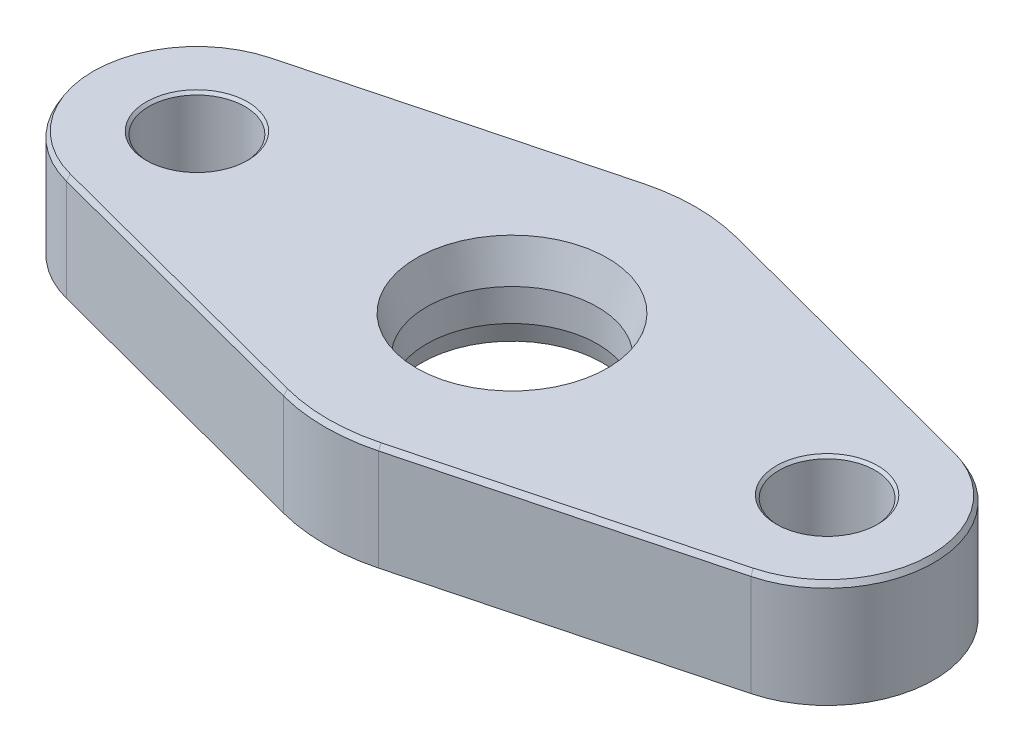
ISO-10303-21;
HEADER;
FILE_DESCRIPTION(('STEP AP214'),'2;1');
FILE_NAME('part.step','',(''),(''),'','','');
FILE_SCHEMA(('AUTOMOTIVE_DESIGN { 1 0 10303 214 1 1 1 1 }'));
ENDSEC;
DATA;
#1=APPLICATION_CONTEXT('core data for automotive mechanical design processes');
#2=APPLICATION_PROTOCOL_DEFINITION('international standard','automotive_design',2000,#1);
#3=PRODUCT_CONTEXT('',#1,'mechanical');
#4=PRODUCT('Part','Part','',(#3));
#5=PRODUCT_RELATED_PRODUCT_CATEGORY('part','',(#4));
#6=PRODUCT_DEFINITION_FORMATION('','',#4);
#7=PRODUCT_DEFINITION_CONTEXT('part definition',#1,'design');
#8=PRODUCT_DEFINITION('design','',#6,#7);
#9=PRODUCT_DEFINITION_SHAPE('','',#8);
#10=(LENGTH_UNIT() NAMED_UNIT(*) SI_UNIT(.MILLI.,.METRE.));
#11=(NAMED_UNIT(*) PLANE_ANGLE_UNIT() SI_UNIT($,.RADIAN.));
#12=(NAMED_UNIT(*) SI_UNIT($,.STERADIAN.) SOLID_ANGLE_UNIT());
#13=UNCERTAINTY_MEASURE_WITH_UNIT(LENGTH_MEASURE(1.E-05),#10,'distance_accuracy_value','');
#14=(GEOMETRIC_REPRESENTATION_CONTEXT(3) GLOBAL_UNCERTAINTY_ASSIGNED_CONTEXT((#13)) GLOBAL_UNIT_ASSIGNED_CONTEXT((#10,
#11,#12)) REPRESENTATION_CONTEXT('',''));
#15=CARTESIAN_POINT('',(0.,0.,0.));
#16=DIRECTION('',(0.,0.,1.));
#17=DIRECTION('',(1.,0.,0.));
#18=AXIS2_PLACEMENT_3D('',#15,#16,#17);
#19=CARTESIAN_POINT('',(0.,0.,0.));
#20=DIRECTION('',(0.,-1.,0.));
#21=DIRECTION('',(0.,0.,-1.));
#22=AXIS2_PLACEMENT_3D('',#19,#20,#21);
#23=PLANE('',#22);
#24=CARTESIAN_POINT('',(-29.5,0.,0.));
#25=DIRECTION('',(0.,1.,0.));
#26=DIRECTION('',(0.,0.,1.));
#27=AXIS2_PLACEMENT_3D('',#24,#25,#26);
#28=CIRCLE('',#27,4.75);
#29=CARTESIAN_POINT('',(-29.5,0.,4.75));
#30=VERTEX_POINT('',#29);
#31=EDGE_CURVE('E566',#30,#30,#28,.T.);
#32=ORIENTED_EDGE('',*,*,#31,.T.);
#33=EDGE_LOOP('',(#32));
#34=FACE_BOUND('',#33,.T.);
#35=CARTESIAN_POINT('',(0.,0.,0.));
#36=DIRECTION('',(0.,1.,0.));
#37=DIRECTION('',(0.,0.,-1.));
#38=AXIS2_PLACEMENT_3D('',#35,#36,#37);
#39=CIRCLE('',#38,17.5);
#40=CARTESIAN_POINT('',(4.44915254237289,0.,-16.9249827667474));
#41=VERTEX_POINT('',#40);
#42=CARTESIAN_POINT('',(-4.44915254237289,0.,-16.9249827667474));
#43=VERTEX_POINT('',#42);
#44=EDGE_CURVE('E137',#41,#43,#39,.T.);
#45=ORIENTED_EDGE('',*,*,#44,.F.);
#46=DIRECTION('',(-0.967141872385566,0.,-0.254237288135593));
#47=VECTOR('',#46,1.);
#48=CARTESIAN_POINT('',(32.0423728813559,0.,-9.67141872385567));
#49=LINE('',#48,#47);
#50=CARTESIAN_POINT('',(32.0423728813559,0.,-9.67141872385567));
#51=VERTEX_POINT('',#50);
#52=EDGE_CURVE('E165',#51,#41,#49,.T.);
#53=ORIENTED_EDGE('',*,*,#52,.F.);
#54=CARTESIAN_POINT('',(29.5,0.,0.));
#55=DIRECTION('',(0.,1.,0.));
#56=DIRECTION('',(0.,0.,-1.));
#57=AXIS2_PLACEMENT_3D('',#54,#55,#56);
#58=CIRCLE('',#57,10.);
#59=CARTESIAN_POINT('',(32.0423728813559,0.,9.67141872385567));
#60=VERTEX_POINT('',#59);
#61=EDGE_CURVE('E162',#60,#51,#58,.T.);
#62=ORIENTED_EDGE('',*,*,#61,.F.);
#63=DIRECTION('',(0.967141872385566,0.,-0.254237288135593));
#64=VECTOR('',#63,1.);
#65=CARTESIAN_POINT('',(32.0423728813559,0.,9.67141872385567));
#66=LINE('',#65,#64);
#67=CARTESIAN_POINT('',(4.44915254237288,0.,16.9249827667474));
#68=VERTEX_POINT('',#67);
#69=EDGE_CURVE('E159',#68,#60,#66,.T.);
#70=ORIENTED_EDGE('',*,*,#69,.F.);
#71=CARTESIAN_POINT('',(0.,0.,0.));
#72=DIRECTION('',(0.,1.,0.));
#73=DIRECTION('',(0.,0.,1.));
#74=AXIS2_PLACEMENT_3D('',#71,#72,#73);
#75=CIRCLE('',#74,17.5);
#76=CARTESIAN_POINT('',(-4.44915254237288,0.,16.9249827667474));
#77=VERTEX_POINT('',#76);
#78=EDGE_CURVE('E156',#77,#68,#75,.T.);
#79=ORIENTED_EDGE('',*,*,#78,.F.);
#80=DIRECTION('',(0.967141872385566,0.,0.254237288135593));
#81=VECTOR('',#80,1.);
#82=CARTESIAN_POINT('',(-32.0423728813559,0.,9.67141872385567));
#83=LINE('',#82,#81);
#84=CARTESIAN_POINT('',(-32.0423728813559,0.,9.67141872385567));
#85=VERTEX_POINT('',#84);
#86=EDGE_CURVE('E153',#85,#77,#83,.T.);
#87=ORIENTED_EDGE('',*,*,#86,.F.);
#88=CARTESIAN_POINT('',(-29.5,0.,0.));
#89=DIRECTION('',(0.,1.,0.));
#90=DIRECTION('',(0.,0.,1.));
#91=AXIS2_PLACEMENT_3D('',#88,#89,#90);
#92=CIRCLE('',#91,10.);
#93=CARTESIAN_POINT('',(-32.0423728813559,0.,-9.67141872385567));
#94=VERTEX_POINT('',#93);
#95=EDGE_CURVE('E140',#94,#85,#92,.T.);
#96=ORIENTED_EDGE('',*,*,#95,.F.);
#97=DIRECTION('',(-0.967141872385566,0.,0.254237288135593));
#98=VECTOR('',#97,1.);
#99=CARTESIAN_POINT('',(-32.0423728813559,0.,-9.67141872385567));
#100=LINE('',#99,#98);
#101=EDGE_CURVE('E123',#43,#94,#100,.T.);
#102=ORIENTED_EDGE('',*,*,#101,.F.);
#103=EDGE_LOOP('',(#45,#53,#62,#70,#79,#87,#96,#102));
#104=FACE_BOUND('',#103,.T.);
#105=CARTESIAN_POINT('',(0.,0.,0.));
#106=DIRECTION('',(0.,-1.,0.));
#107=DIRECTION('',(0.,0.,-1.));
#108=AXIS2_PLACEMENT_3D('',#105,#106,#107);
#109=CIRCLE('',#108,14.9282032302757);
#110=CARTESIAN_POINT('',(0.,0.,-14.9282032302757));
#111=VERTEX_POINT('',#110);
#112=EDGE_CURVE('E225',#111,#111,#109,.F.);
#113=ORIENTED_EDGE('',*,*,#112,.T.);
#114=EDGE_LOOP('',(#113));
#115=FACE_BOUND('',#114,.T.);
#116=CARTESIAN_POINT('',(29.5,0.,-2.05997518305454E-13));
#117=DIRECTION('',(0.,1.,0.));
#118=DIRECTION('',(0.,0.,1.));
#119=AXIS2_PLACEMENT_3D('',#116,#117,#118);
#120=CIRCLE('',#119,4.75);
#121=CARTESIAN_POINT('',(29.5,0.,4.74999999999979));
#122=VERTEX_POINT('',#121);
#123=EDGE_CURVE('E554',#122,#122,#120,.T.);
#124=ORIENTED_EDGE('',*,*,#123,.T.);
#125=EDGE_LOOP('',(#124));
#126=FACE_BOUND('',#125,.T.);
#127=ADVANCED_FACE('F28',(#34,#104,#115,#126),#23,.T.);
#128=CARTESIAN_POINT('',(0.,0.,0.));
#129=DIRECTION('',(0.,-1.,0.));
#130=DIRECTION('',(0.,0.,-1.));
#131=AXIS2_PLACEMENT_3D('',#128,#129,#130);
#132=CONICAL_SURFACE('',#131,8.93782217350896,0.261799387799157);
#133=CARTESIAN_POINT('',(0.,3.5,0.));
#134=DIRECTION('',(0.,-1.,0.));
#135=DIRECTION('',(0.,0.,-1.));
#136=AXIS2_PLACEMENT_3D('',#133,#134,#135);
#137=CIRCLE('',#136,8.);
#138=CARTESIAN_POINT('',(0.,3.5,-8.));
#139=VERTEX_POINT('',#138);
#140=EDGE_CURVE('E37',#139,#139,#137,.T.);
#141=ORIENTED_EDGE('',*,*,#140,.F.);
#142=EDGE_LOOP('',(#141));
#143=FACE_BOUND('',#142,.T.);
#144=CARTESIAN_POINT('',(0.,1.72927405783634,0.));
#145=DIRECTION('',(0.,-1.,0.));
#146=DIRECTION('',(0.,0.,-1.));
#147=AXIS2_PLACEMENT_3D('',#144,#145,#146);
#148=CIRCLE('',#147,8.47446458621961);
#149=CARTESIAN_POINT('',(0.,1.72927405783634,-8.47446458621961));
#150=VERTEX_POINT('',#149);
#151=EDGE_CURVE('E32',#150,#150,#148,.T.);
#152=ORIENTED_EDGE('',*,*,#151,.T.);
#153=EDGE_LOOP('',(#152));
#154=FACE_BOUND('',#153,.T.);
#155=ADVANCED_FACE('F218',(#143,#154),#132,.F.);
#156=CARTESIAN_POINT('',(0.,9.99999999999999,0.));
#157=DIRECTION('',(0.,-1.,0.));
#158=DIRECTION('',(0.,0.,-1.));
#159=AXIS2_PLACEMENT_3D('',#156,#157,#158);
#160=CYLINDRICAL_SURFACE('',#159,17.5);
#161=DIRECTION('',(0.,-1.,0.));
#162=VECTOR('',#161,1.);
#163=CARTESIAN_POINT('',(-4.44915254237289,9.99999999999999,-16.9249827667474));
#164=LINE('',#163,#162);
#165=CARTESIAN_POINT('',(-4.44915254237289,9.49999999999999,-16.9249827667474));
#166=VERTEX_POINT('',#165);
#167=EDGE_CURVE('E119',#166,#43,#164,.T.);
#168=ORIENTED_EDGE('',*,*,#167,.F.);
#169=CARTESIAN_POINT('',(0.,9.49999999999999,0.));
#170=DIRECTION('',(0.,-1.,0.));
#171=DIRECTION('',(0.,0.,-1.));
#172=AXIS2_PLACEMENT_3D('',#169,#170,#171);
#173=CIRCLE('',#172,17.5);
#174=CARTESIAN_POINT('',(4.44915254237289,9.49999999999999,-16.9249827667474));
#175=VERTEX_POINT('',#174);
#176=EDGE_CURVE('E198',#166,#175,#173,.T.);
#177=ORIENTED_EDGE('',*,*,#176,.T.);
#178=DIRECTION('',(0.,-1.,0.));
#179=VECTOR('',#178,1.);
#180=CARTESIAN_POINT('',(4.44915254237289,9.99999999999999,-16.9249827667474));
#181=LINE('',#180,#179);
#182=EDGE_CURVE('E143',#175,#41,#181,.T.);
#183=ORIENTED_EDGE('',*,*,#182,.T.);
#184=ORIENTED_EDGE('',*,*,#44,.T.);
#185=EDGE_LOOP('',(#168,#177,#183,#184));
#186=FACE_BOUND('',#185,.T.);
#187=ADVANCED_FACE('F30',(#186),#160,.T.);
#188=CARTESIAN_POINT('',(-32.0423728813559,9.99999999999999,-9.67141872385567));
#189=DIRECTION('',(0.254237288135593,0.,0.967141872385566));
#190=DIRECTION('',(0.967141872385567,0.,-0.254237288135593));
#191=AXIS2_PLACEMENT_3D('',#188,#189,#190);
#192=PLANE('',#191);
#193=DIRECTION('',(0.,-1.,0.));
#194=VECTOR('',#193,1.);
#195=CARTESIAN_POINT('',(-32.0423728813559,9.99999999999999,-9.67141872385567));
#196=LINE('',#195,#194);
#197=CARTESIAN_POINT('',(-32.0423728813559,9.49999999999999,-9.67141872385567));
#198=VERTEX_POINT('',#197);
#199=EDGE_CURVE('E131',#198,#94,#196,.T.);
#200=ORIENTED_EDGE('',*,*,#199,.F.);
#201=DIRECTION('',(0.967141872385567,0.,-0.254237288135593));
#202=VECTOR('',#201,1.);
#203=CARTESIAN_POINT('',(-32.0423728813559,9.49999999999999,-9.67141872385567));
#204=LINE('',#203,#202);
#205=EDGE_CURVE('E126',#198,#166,#204,.T.);
#206=ORIENTED_EDGE('',*,*,#205,.T.);
#207=ORIENTED_EDGE('',*,*,#167,.T.);
#208=ORIENTED_EDGE('',*,*,#101,.T.);
#209=EDGE_LOOP('',(#200,#206,#207,#208));
#210=FACE_BOUND('',#209,.T.);
#211=ADVANCED_FACE('F122',(#210),#192,.F.);
#212=CARTESIAN_POINT('',(-29.5,9.99999999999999,0.));
#213=DIRECTION('',(0.,-1.,0.));
#214=DIRECTION('',(0.,0.,-1.));
#215=AXIS2_PLACEMENT_3D('',#212,#213,#214);
#216=CYLINDRICAL_SURFACE('',#215,10.);
#217=DIRECTION('',(0.,-1.,0.));
#218=VECTOR('',#217,1.);
#219=CARTESIAN_POINT('',(-32.0423728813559,9.99999999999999,9.67141872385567));
#220=LINE('',#219,#218);
#221=CARTESIAN_POINT('',(-32.0423728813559,9.49999999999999,9.67141872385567));
#222=VERTEX_POINT('',#221);
#223=EDGE_CURVE('E176',#222,#85,#220,.T.);
#224=ORIENTED_EDGE('',*,*,#223,.F.);
#225=CARTESIAN_POINT('',(-29.5,9.49999999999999,0.));
#226=DIRECTION('',(0.,-1.,0.));
#227=DIRECTION('',(0.,0.,-1.));
#228=AXIS2_PLACEMENT_3D('',#225,#226,#227);
#229=CIRCLE('',#228,10.);
#230=EDGE_CURVE('E205',#222,#198,#229,.T.);
#231=ORIENTED_EDGE('',*,*,#230,.T.);
#232=ORIENTED_EDGE('',*,*,#199,.T.);
#233=ORIENTED_EDGE('',*,*,#95,.T.);
#234=EDGE_LOOP('',(#224,#231,#232,#233));
#235=FACE_BOUND('',#234,.T.);
#236=ADVANCED_FACE('F334',(#235),#216,.T.);
#237=CARTESIAN_POINT('',(-32.0423728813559,9.99999999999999,9.67141872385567));
#238=DIRECTION('',(0.254237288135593,0.,-0.967141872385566));
#239=DIRECTION('',(-0.967141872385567,0.,-0.254237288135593));
#240=AXIS2_PLACEMENT_3D('',#237,#238,#239);
#241=PLANE('',#240);
#242=DIRECTION('',(0.,-1.,0.));
#243=VECTOR('',#242,1.);
#244=CARTESIAN_POINT('',(-4.44915254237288,9.99999999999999,16.9249827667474));
#245=LINE('',#244,#243);
#246=CARTESIAN_POINT('',(-4.44915254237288,9.49999999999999,16.9249827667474));
#247=VERTEX_POINT('',#246);
#248=EDGE_CURVE('E174',#247,#77,#245,.T.);
#249=ORIENTED_EDGE('',*,*,#248,.F.);
#250=DIRECTION('',(-0.967141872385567,0.,-0.254237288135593));
#251=VECTOR('',#250,1.);
#252=CARTESIAN_POINT('',(-32.0423728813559,9.49999999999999,9.67141872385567));
#253=LINE('',#252,#251);
#254=EDGE_CURVE('E51',#247,#222,#253,.T.);
#255=ORIENTED_EDGE('',*,*,#254,.T.);
#256=ORIENTED_EDGE('',*,*,#223,.T.);
#257=ORIENTED_EDGE('',*,*,#86,.T.);
#258=EDGE_LOOP('',(#249,#255,#256,#257));
#259=FACE_BOUND('',#258,.T.);
#260=ADVANCED_FACE('F331',(#259),#241,.F.);
#261=CARTESIAN_POINT('',(0.,9.99999999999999,0.));
#262=DIRECTION('',(0.,-1.,0.));
#263=DIRECTION('',(0.,0.,-1.));
#264=AXIS2_PLACEMENT_3D('',#261,#262,#263);
#265=CYLINDRICAL_SURFACE('',#264,17.5);
#266=DIRECTION('',(0.,-1.,0.));
#267=VECTOR('',#266,1.);
#268=CARTESIAN_POINT('',(4.44915254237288,9.99999999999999,16.9249827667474));
#269=LINE('',#268,#267);
#270=CARTESIAN_POINT('',(4.44915254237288,9.49999999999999,16.9249827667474));
#271=VERTEX_POINT('',#270);
#272=EDGE_CURVE('E172',#271,#68,#269,.T.);
#273=ORIENTED_EDGE('',*,*,#272,.F.);
#274=CARTESIAN_POINT('',(0.,9.49999999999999,0.));
#275=DIRECTION('',(0.,-1.,0.));
#276=DIRECTION('',(0.,0.,-1.));
#277=AXIS2_PLACEMENT_3D('',#274,#275,#276);
#278=CIRCLE('',#277,17.5);
#279=EDGE_CURVE('E44',#271,#247,#278,.T.);
#280=ORIENTED_EDGE('',*,*,#279,.T.);
#281=ORIENTED_EDGE('',*,*,#248,.T.);
#282=ORIENTED_EDGE('',*,*,#78,.T.);
#283=EDGE_LOOP('',(#273,#280,#281,#282));
#284=FACE_BOUND('',#283,.T.);
#285=ADVANCED_FACE('F328',(#284),#265,.T.);
#286=CARTESIAN_POINT('',(32.0423728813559,9.99999999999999,9.67141872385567));
#287=DIRECTION('',(-0.254237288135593,0.,-0.967141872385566));
#288=DIRECTION('',(-0.967141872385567,0.,0.254237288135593));
#289=AXIS2_PLACEMENT_3D('',#286,#287,#288);
#290=PLANE('',#289);
#291=DIRECTION('',(0.,-1.,0.));
#292=VECTOR('',#291,1.);
#293=CARTESIAN_POINT('',(32.0423728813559,9.99999999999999,9.67141872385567));
#294=LINE('',#293,#292);
#295=CARTESIAN_POINT('',(32.0423728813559,9.49999999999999,9.67141872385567));
#296=VERTEX_POINT('',#295);
#297=EDGE_CURVE('E170',#296,#60,#294,.T.);
#298=ORIENTED_EDGE('',*,*,#297,.F.);
#299=DIRECTION('',(-0.967141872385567,0.,0.254237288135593));
#300=VECTOR('',#299,1.);
#301=CARTESIAN_POINT('',(32.0423728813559,9.49999999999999,9.67141872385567));
#302=LINE('',#301,#300);
#303=EDGE_CURVE('E203',#296,#271,#302,.T.);
#304=ORIENTED_EDGE('',*,*,#303,.T.);
#305=ORIENTED_EDGE('',*,*,#272,.T.);
#306=ORIENTED_EDGE('',*,*,#69,.T.);
#307=EDGE_LOOP('',(#298,#304,#305,#306));
#308=FACE_BOUND('',#307,.T.);
#309=ADVANCED_FACE('F295',(#308),#290,.F.);
#310=CARTESIAN_POINT('',(29.5,9.99999999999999,0.));
#311=DIRECTION('',(0.,-1.,0.));
#312=DIRECTION('',(0.,0.,-1.));
#313=AXIS2_PLACEMENT_3D('',#310,#311,#312);
#314=CYLINDRICAL_SURFACE('',#313,10.);
#315=DIRECTION('',(0.,-1.,0.));
#316=VECTOR('',#315,1.);
#317=CARTESIAN_POINT('',(32.0423728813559,9.99999999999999,-9.67141872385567));
#318=LINE('',#317,#316);
#319=CARTESIAN_POINT('',(32.0423728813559,9.49999999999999,-9.67141872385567));
#320=VERTEX_POINT('',#319);
#321=EDGE_CURVE('E168',#320,#51,#318,.T.);
#322=ORIENTED_EDGE('',*,*,#321,.F.);
#323=CARTESIAN_POINT('',(29.5,9.49999999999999,0.));
#324=DIRECTION('',(0.,-1.,0.));
#325=DIRECTION('',(0.,0.,-1.));
#326=AXIS2_PLACEMENT_3D('',#323,#324,#325);
#327=CIRCLE('',#326,10.);
#328=EDGE_CURVE('E200',#320,#296,#327,.T.);
#329=ORIENTED_EDGE('',*,*,#328,.T.);
#330=ORIENTED_EDGE('',*,*,#297,.T.);
#331=ORIENTED_EDGE('',*,*,#61,.T.);
#332=EDGE_LOOP('',(#322,#329,#330,#331));
#333=FACE_BOUND('',#332,.T.);
#334=ADVANCED_FACE('F292',(#333),#314,.T.);
#335=CARTESIAN_POINT('',(32.0423728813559,9.99999999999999,-9.67141872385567));
#336=DIRECTION('',(-0.254237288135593,0.,0.967141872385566));
#337=DIRECTION('',(0.967141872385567,0.,0.254237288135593));
#338=AXIS2_PLACEMENT_3D('',#335,#336,#337);
#339=PLANE('',#338);
#340=ORIENTED_EDGE('',*,*,#182,.F.);
#341=DIRECTION('',(0.967141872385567,0.,0.254237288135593));
#342=VECTOR('',#341,1.);
#343=CARTESIAN_POINT('',(32.0423728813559,9.49999999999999,-9.67141872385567));
#344=LINE('',#343,#342);
#345=EDGE_CURVE('E195',#175,#320,#344,.T.);
#346=ORIENTED_EDGE('',*,*,#345,.T.);
#347=ORIENTED_EDGE('',*,*,#321,.T.);
#348=ORIENTED_EDGE('',*,*,#52,.T.);
#349=EDGE_LOOP('',(#340,#346,#347,#348));
#350=FACE_BOUND('',#349,.T.);
#351=ADVANCED_FACE('F279',(#350),#339,.F.);
#352=CARTESIAN_POINT('',(0.,9.99999999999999,0.));
#353=DIRECTION('',(0.,-1.,0.));
#354=DIRECTION('',(0.,0.,-1.));
#355=AXIS2_PLACEMENT_3D('',#352,#353,#354);
#356=PLANE('',#355);
#357=CARTESIAN_POINT('',(29.5,9.99999999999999,-2.05997518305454E-13));
#358=DIRECTION('',(0.,1.,0.));
#359=DIRECTION('',(0.,0.,1.));
#360=AXIS2_PLACEMENT_3D('',#357,#358,#359);
#361=CIRCLE('',#360,4.75);
#362=CARTESIAN_POINT('',(29.5,9.99999999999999,4.7499999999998));
#363=VERTEX_POINT('',#362);
#364=EDGE_CURVE('E563',#363,#363,#361,.T.);
#365=ORIENTED_EDGE('',*,*,#364,.F.);
#366=EDGE_LOOP('',(#365));
#367=FACE_BOUND('',#366,.T.);
#368=CARTESIAN_POINT('',(-29.5,9.99999999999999,0.));
#369=DIRECTION('',(0.,1.,0.));
#370=DIRECTION('',(0.,0.,1.));
#371=AXIS2_PLACEMENT_3D('',#368,#369,#370);
#372=CIRCLE('',#371,4.75);
#373=CARTESIAN_POINT('',(-29.5,9.99999999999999,4.75));
#374=VERTEX_POINT('',#373);
#375=EDGE_CURVE('E226',#374,#374,#372,.T.);
#376=ORIENTED_EDGE('',*,*,#375,.F.);
#377=EDGE_LOOP('',(#376));
#378=FACE_BOUND('',#377,.T.);
#379=CARTESIAN_POINT('',(0.,9.99999999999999,0.));
#380=DIRECTION('',(0.,-1.,0.));
#381=DIRECTION('',(0.,0.,-1.));
#382=AXIS2_PLACEMENT_3D('',#379,#380,#381);
#383=CIRCLE('',#382,8.93782217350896);
#384=CARTESIAN_POINT('',(0.,10.,8.93782217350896));
#385=VERTEX_POINT('',#384);
#386=EDGE_CURVE('E11',#385,#385,#383,.T.);
#387=ORIENTED_EDGE('',*,*,#386,.T.);
#388=EDGE_LOOP('',(#387));
#389=FACE_BOUND('',#388,.T.);
#390=CARTESIAN_POINT('',(29.5,9.99999999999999,0.));
#391=DIRECTION('',(0.,-1.,0.));
#392=DIRECTION('',(0.,0.,-1.));
#393=AXIS2_PLACEMENT_3D('',#390,#391,#392);
#394=CIRCLE('',#393,9.71132486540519);
#395=CARTESIAN_POINT('',(31.9689808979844,9.99999999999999,9.39222891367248));
#396=VERTEX_POINT('',#395);
#397=CARTESIAN_POINT('',(31.9689808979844,9.99999999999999,-9.39222891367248));
#398=VERTEX_POINT('',#397);
#399=EDGE_CURVE('E188',#396,#398,#394,.F.);
#400=ORIENTED_EDGE('',*,*,#399,.T.);
#401=DIRECTION('',(-0.967141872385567,0.,-0.254237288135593));
#402=VECTOR('',#401,1.);
#403=CARTESIAN_POINT('',(4.37576055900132,9.99999999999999,-16.6457929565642));
#404=LINE('',#403,#402);
#405=CARTESIAN_POINT('',(4.37576055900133,9.99999999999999,-16.6457929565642));
#406=VERTEX_POINT('',#405);
#407=EDGE_CURVE('E192',#398,#406,#404,.T.);
#408=ORIENTED_EDGE('',*,*,#407,.T.);
#409=CARTESIAN_POINT('',(0.,9.99999999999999,0.));
#410=DIRECTION('',(0.,-1.,0.));
#411=DIRECTION('',(0.,0.,-1.));
#412=AXIS2_PLACEMENT_3D('',#409,#410,#411);
#413=CIRCLE('',#412,17.2113248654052);
#414=CARTESIAN_POINT('',(-4.37576055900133,9.99999999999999,-16.6457929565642));
#415=VERTEX_POINT('',#414);
#416=EDGE_CURVE('E190',#406,#415,#413,.F.);
#417=ORIENTED_EDGE('',*,*,#416,.T.);
#418=DIRECTION('',(-0.967141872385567,0.,0.254237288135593));
#419=VECTOR('',#418,1.);
#420=CARTESIAN_POINT('',(-4.37576055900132,9.99999999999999,-16.6457929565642));
#421=LINE('',#420,#419);
#422=CARTESIAN_POINT('',(-31.9689808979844,9.99999999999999,-9.39222891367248));
#423=VERTEX_POINT('',#422);
#424=EDGE_CURVE('E186',#415,#423,#421,.T.);
#425=ORIENTED_EDGE('',*,*,#424,.T.);
#426=CARTESIAN_POINT('',(-29.5,9.99999999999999,0.));
#427=DIRECTION('',(0.,-1.,0.));
#428=DIRECTION('',(0.,0.,-1.));
#429=AXIS2_PLACEMENT_3D('',#426,#427,#428);
#430=CIRCLE('',#429,9.71132486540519);
#431=CARTESIAN_POINT('',(-31.9689808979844,9.99999999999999,9.39222891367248));
#432=VERTEX_POINT('',#431);
#433=EDGE_CURVE('E182',#423,#432,#430,.F.);
#434=ORIENTED_EDGE('',*,*,#433,.T.);
#435=DIRECTION('',(0.967141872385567,0.,0.254237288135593));
#436=VECTOR('',#435,1.);
#437=CARTESIAN_POINT('',(-4.37576055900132,9.99999999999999,16.6457929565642));
#438=LINE('',#437,#436);
#439=CARTESIAN_POINT('',(-4.37576055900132,9.99999999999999,16.6457929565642));
#440=VERTEX_POINT('',#439);
#441=EDGE_CURVE('E130',#432,#440,#438,.T.);
#442=ORIENTED_EDGE('',*,*,#441,.T.);
#443=CARTESIAN_POINT('',(0.,9.99999999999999,0.));
#444=DIRECTION('',(0.,-1.,0.));
#445=DIRECTION('',(0.,0.,-1.));
#446=AXIS2_PLACEMENT_3D('',#443,#444,#445);
#447=CIRCLE('',#446,17.2113248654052);
#448=CARTESIAN_POINT('',(4.37576055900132,9.99999999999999,16.6457929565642));
#449=VERTEX_POINT('',#448);
#450=EDGE_CURVE('E180',#440,#449,#447,.F.);
#451=ORIENTED_EDGE('',*,*,#450,.T.);
#452=DIRECTION('',(0.967141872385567,0.,-0.254237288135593));
#453=VECTOR('',#452,1.);
#454=CARTESIAN_POINT('',(4.37576055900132,9.99999999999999,16.6457929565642));
#455=LINE('',#454,#453);
#456=EDGE_CURVE('E184',#449,#396,#455,.T.);
#457=ORIENTED_EDGE('',*,*,#456,.T.);
#458=EDGE_LOOP('',(#400,#408,#417,#425,#434,#442,#451,#457));
#459=FACE_BOUND('',#458,.T.);
#460=ADVANCED_FACE('F267',(#367,#378,#389,#459),#356,.F.);
#461=CARTESIAN_POINT('',(0.,0.,0.));
#462=DIRECTION('',(0.,1.,0.));
#463=DIRECTION('',(0.,0.,1.));
#464=AXIS2_PLACEMENT_3D('',#461,#462,#463);
#465=CYLINDRICAL_SURFACE('',#464,8.);
#466=ORIENTED_EDGE('',*,*,#140,.T.);
#467=EDGE_LOOP('',(#466));
#468=FACE_BOUND('',#467,.T.);
#469=CARTESIAN_POINT('',(0.,6.49999999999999,0.));
#470=DIRECTION('',(0.,-1.,0.));
#471=DIRECTION('',(0.,0.,-1.));
#472=AXIS2_PLACEMENT_3D('',#469,#470,#471);
#473=CIRCLE('',#472,8.);
#474=CARTESIAN_POINT('',(0.,6.49999999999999,8.));
#475=VERTEX_POINT('',#474);
#476=EDGE_CURVE('E209',#475,#475,#473,.F.);
#477=ORIENTED_EDGE('',*,*,#476,.T.);
#478=EDGE_LOOP('',(#477));
#479=FACE_BOUND('',#478,.T.);
#480=ADVANCED_FACE('F215',(#468,#479),#465,.F.);
#481=CARTESIAN_POINT('',(-4.37576055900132,9.99999999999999,16.6457929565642));
#482=DIRECTION('',(0.220175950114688,-0.500000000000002,-0.837569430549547));
#483=DIRECTION('',(0.,0.858640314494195,-0.512578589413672));
#484=AXIS2_PLACEMENT_3D('',#481,#482,#483);
#485=PLANE('',#484);
#486=DIRECTION('',(0.127118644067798,0.866025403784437,-0.483570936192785));
#487=VECTOR('',#486,1.);
#488=CARTESIAN_POINT('',(-32.0423728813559,9.49999999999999,9.67141872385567));
#489=LINE('',#488,#487);
#490=EDGE_CURVE('E148',#222,#432,#489,.T.);
#491=ORIENTED_EDGE('',*,*,#490,.F.);
#492=ORIENTED_EDGE('',*,*,#254,.F.);
#493=DIRECTION('',(-0.127118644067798,-0.866025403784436,0.483570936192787));
#494=VECTOR('',#493,1.);
#495=CARTESIAN_POINT('',(-4.37576055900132,9.99999999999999,16.6457929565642));
#496=LINE('',#495,#494);
#497=EDGE_CURVE('E145',#440,#247,#496,.T.);
#498=ORIENTED_EDGE('',*,*,#497,.F.);
#499=ORIENTED_EDGE('',*,*,#441,.F.);
#500=EDGE_LOOP('',(#491,#492,#498,#499));
#501=FACE_BOUND('',#500,.T.);
#502=ADVANCED_FACE('F263',(#501),#485,.F.);
#503=CARTESIAN_POINT('',(0.,9.99999999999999,0.));
#504=DIRECTION('',(0.,-1.,0.));
#505=DIRECTION('',(0.,0.,-1.));
#506=AXIS2_PLACEMENT_3D('',#503,#504,#505);
#507=CONICAL_SURFACE('',#506,17.2113248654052,0.523598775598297);
#508=ORIENTED_EDGE('',*,*,#497,.T.);
#509=ORIENTED_EDGE('',*,*,#279,.F.);
#510=DIRECTION('',(0.127118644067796,-0.866025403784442,0.483570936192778));
#511=VECTOR('',#510,1.);
#512=CARTESIAN_POINT('',(4.37576055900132,9.99999999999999,16.6457929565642));
#513=LINE('',#512,#511);
#514=EDGE_CURVE('E252',#449,#271,#513,.T.);
#515=ORIENTED_EDGE('',*,*,#514,.F.);
#516=ORIENTED_EDGE('',*,*,#450,.F.);
#517=EDGE_LOOP('',(#508,#509,#515,#516));
#518=FACE_BOUND('',#517,.T.);
#519=ADVANCED_FACE('F302',(#518),#507,.T.);
#520=CARTESIAN_POINT('',(-29.5,9.99999999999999,0.));
#521=DIRECTION('',(0.,-1.,0.));
#522=DIRECTION('',(0.,0.,-1.));
#523=AXIS2_PLACEMENT_3D('',#520,#521,#522);
#524=CONICAL_SURFACE('',#523,9.71132486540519,0.5235987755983);
#525=ORIENTED_EDGE('',*,*,#490,.T.);
#526=ORIENTED_EDGE('',*,*,#433,.F.);
#527=DIRECTION('',(0.127118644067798,0.866025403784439,0.483570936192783));
#528=VECTOR('',#527,1.);
#529=CARTESIAN_POINT('',(-32.0423728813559,9.49999999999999,-9.67141872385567));
#530=LINE('',#529,#528);
#531=EDGE_CURVE('E249',#198,#423,#530,.T.);
#532=ORIENTED_EDGE('',*,*,#531,.F.);
#533=ORIENTED_EDGE('',*,*,#230,.F.);
#534=EDGE_LOOP('',(#525,#526,#532,#533));
#535=FACE_BOUND('',#534,.T.);
#536=ADVANCED_FACE('F259',(#535),#524,.T.);
#537=CARTESIAN_POINT('',(4.37576055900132,9.99999999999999,16.6457929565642));
#538=DIRECTION('',(-0.220175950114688,-0.500000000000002,-0.837569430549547));
#539=DIRECTION('',(0.,0.858640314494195,-0.512578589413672));
#540=AXIS2_PLACEMENT_3D('',#537,#538,#539);
#541=PLANE('',#540);
#542=ORIENTED_EDGE('',*,*,#514,.T.);
#543=ORIENTED_EDGE('',*,*,#303,.F.);
#544=DIRECTION('',(0.127118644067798,-0.866025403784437,0.483570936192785));
#545=VECTOR('',#544,1.);
#546=CARTESIAN_POINT('',(31.9689808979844,9.99999999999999,9.39222891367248));
#547=LINE('',#546,#545);
#548=EDGE_CURVE('E246',#396,#296,#547,.T.);
#549=ORIENTED_EDGE('',*,*,#548,.F.);
#550=ORIENTED_EDGE('',*,*,#456,.F.);
#551=EDGE_LOOP('',(#542,#543,#549,#550));
#552=FACE_BOUND('',#551,.T.);
#553=ADVANCED_FACE('F299',(#552),#541,.F.);
#554=CARTESIAN_POINT('',(-4.37576055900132,9.99999999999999,-16.6457929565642));
#555=DIRECTION('',(0.220175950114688,-0.499999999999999,0.837569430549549));
#556=DIRECTION('',(0.,-0.858640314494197,-0.512578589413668));
#557=AXIS2_PLACEMENT_3D('',#554,#555,#556);
#558=PLANE('',#557);
#559=ORIENTED_EDGE('',*,*,#531,.T.);
#560=ORIENTED_EDGE('',*,*,#424,.F.);
#561=DIRECTION('',(0.127118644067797,0.866025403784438,0.483570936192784));
#562=VECTOR('',#561,1.);
#563=CARTESIAN_POINT('',(-4.44915254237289,9.49999999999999,-16.9249827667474));
#564=LINE('',#563,#562);
#565=EDGE_CURVE('E243',#166,#415,#564,.T.);
#566=ORIENTED_EDGE('',*,*,#565,.F.);
#567=ORIENTED_EDGE('',*,*,#205,.F.);
#568=EDGE_LOOP('',(#559,#560,#566,#567));
#569=FACE_BOUND('',#568,.T.);
#570=ADVANCED_FACE('F272',(#569),#558,.F.);
#571=CARTESIAN_POINT('',(29.5,9.99999999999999,0.));
#572=DIRECTION('',(0.,-1.,0.));
#573=DIRECTION('',(0.,0.,-1.));
#574=AXIS2_PLACEMENT_3D('',#571,#572,#573);
#575=CONICAL_SURFACE('',#574,9.71132486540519,0.5235987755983);
#576=ORIENTED_EDGE('',*,*,#548,.T.);
#577=ORIENTED_EDGE('',*,*,#328,.F.);
#578=DIRECTION('',(0.127118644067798,-0.866025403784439,-0.483570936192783));
#579=VECTOR('',#578,1.);
#580=CARTESIAN_POINT('',(31.9689808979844,9.99999999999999,-9.39222891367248));
#581=LINE('',#580,#579);
#582=EDGE_CURVE('E241',#398,#320,#581,.T.);
#583=ORIENTED_EDGE('',*,*,#582,.F.);
#584=ORIENTED_EDGE('',*,*,#399,.F.);
#585=EDGE_LOOP('',(#576,#577,#583,#584));
#586=FACE_BOUND('',#585,.T.);
#587=ADVANCED_FACE('F288',(#586),#575,.T.);
#588=CARTESIAN_POINT('',(0.,9.99999999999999,0.));
#589=DIRECTION('',(0.,-1.,0.));
#590=DIRECTION('',(0.,0.,-1.));
#591=AXIS2_PLACEMENT_3D('',#588,#589,#590);
#592=CONICAL_SURFACE('',#591,17.2113248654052,0.523598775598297);
#593=ORIENTED_EDGE('',*,*,#565,.T.);
#594=ORIENTED_EDGE('',*,*,#416,.F.);
#595=DIRECTION('',(-0.127118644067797,0.866025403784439,0.483570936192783));
#596=VECTOR('',#595,1.);
#597=CARTESIAN_POINT('',(4.44915254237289,9.49999999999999,-16.9249827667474));
#598=LINE('',#597,#596);
#599=EDGE_CURVE('E228',#175,#406,#598,.T.);
#600=ORIENTED_EDGE('',*,*,#599,.F.);
#601=ORIENTED_EDGE('',*,*,#176,.F.);
#602=EDGE_LOOP('',(#593,#594,#600,#601));
#603=FACE_BOUND('',#602,.T.);
#604=ADVANCED_FACE('F275',(#603),#592,.T.);
#605=CARTESIAN_POINT('',(4.37576055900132,9.99999999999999,-16.6457929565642));
#606=DIRECTION('',(-0.220175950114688,-0.499999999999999,0.837569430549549));
#607=DIRECTION('',(0.,-0.858640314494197,-0.512578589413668));
#608=AXIS2_PLACEMENT_3D('',#605,#606,#607);
#609=PLANE('',#608);
#610=ORIENTED_EDGE('',*,*,#582,.T.);
#611=ORIENTED_EDGE('',*,*,#345,.F.);
#612=ORIENTED_EDGE('',*,*,#599,.T.);
#613=ORIENTED_EDGE('',*,*,#407,.F.);
#614=EDGE_LOOP('',(#610,#611,#612,#613));
#615=FACE_BOUND('',#614,.T.);
#616=ADVANCED_FACE('F282',(#615),#609,.F.);
#617=CARTESIAN_POINT('',(0.,6.49999999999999,0.));
#618=DIRECTION('',(0.,1.,0.));
#619=DIRECTION('',(0.,0.,1.));
#620=AXIS2_PLACEMENT_3D('',#617,#618,#619);
#621=CONICAL_SURFACE('',#620,8.,0.261799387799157);
#622=CARTESIAN_POINT('',(0.,10.,8.93782217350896));
#623=CARTESIAN_POINT('',(0.,9.96354166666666,8.92805319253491));
#624=CARTESIAN_POINT('',(0.,9.92708333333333,8.91828421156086));
#625=CARTESIAN_POINT('',(0.,9.85416666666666,8.89874624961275));
#626=CARTESIAN_POINT('',(0.,9.81770833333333,8.8889772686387));
#627=CARTESIAN_POINT('',(0.,9.74479166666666,8.8694393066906));
#628=CARTESIAN_POINT('',(0.,9.70833333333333,8.85967032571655));
#629=CARTESIAN_POINT('',(0.,9.63541666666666,8.84013236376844));
#630=CARTESIAN_POINT('',(0.,9.59895833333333,8.83036338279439));
#631=CARTESIAN_POINT('',(0.,9.52604166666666,8.81082542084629));
#632=CARTESIAN_POINT('',(0.,9.48958333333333,8.80105643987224));
#633=CARTESIAN_POINT('',(0.,9.41666666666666,8.78151847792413));
#634=CARTESIAN_POINT('',(0.,9.38020833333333,8.77174949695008));
#635=CARTESIAN_POINT('',(0.,9.30729166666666,8.75221153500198));
#636=CARTESIAN_POINT('',(0.,9.27083333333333,8.74244255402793));
#637=CARTESIAN_POINT('',(0.,9.19791666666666,8.72290459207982));
#638=CARTESIAN_POINT('',(0.,9.16145833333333,8.71313561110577));
#639=CARTESIAN_POINT('',(0.,9.08854166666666,8.69359764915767));
#640=CARTESIAN_POINT('',(0.,9.05208333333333,8.68382866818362));
#641=CARTESIAN_POINT('',(0.,8.97916666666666,8.66429070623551));
#642=CARTESIAN_POINT('',(0.,8.94270833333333,8.65452172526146));
#643=CARTESIAN_POINT('',(0.,8.86979166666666,8.63498376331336));
#644=CARTESIAN_POINT('',(0.,8.83333333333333,8.62521478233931));
#645=CARTESIAN_POINT('',(0.,8.76041666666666,8.6056768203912));
#646=CARTESIAN_POINT('',(0.,8.72395833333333,8.59590783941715));
#647=CARTESIAN_POINT('',(0.,8.65104166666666,8.57636987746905));
#648=CARTESIAN_POINT('',(0.,8.61458333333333,8.566600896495));
#649=CARTESIAN_POINT('',(0.,8.54166666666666,8.54706293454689));
#650=CARTESIAN_POINT('',(0.,8.50520833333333,8.53729395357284));
#651=CARTESIAN_POINT('',(0.,8.43229166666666,8.51775599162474));
#652=CARTESIAN_POINT('',(0.,8.39583333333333,8.50798701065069));
#653=CARTESIAN_POINT('',(0.,8.32291666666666,8.48844904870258));
#654=CARTESIAN_POINT('',(0.,8.28645833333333,8.47868006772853));
#655=CARTESIAN_POINT('',(0.,8.21354166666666,8.45914210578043));
#656=CARTESIAN_POINT('',(0.,8.17708333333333,8.44937312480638));
#657=CARTESIAN_POINT('',(0.,8.10416666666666,8.42983516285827));
#658=CARTESIAN_POINT('',(0.,8.06770833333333,8.42006618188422));
#659=CARTESIAN_POINT('',(0.,7.99479166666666,8.40052821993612));
#660=CARTESIAN_POINT('',(0.,7.95833333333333,8.39075923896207));
#661=CARTESIAN_POINT('',(0.,7.88541666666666,8.37122127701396));
#662=CARTESIAN_POINT('',(0.,7.84895833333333,8.36145229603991));
#663=CARTESIAN_POINT('',(0.,7.77604166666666,8.34191433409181));
#664=CARTESIAN_POINT('',(0.,7.73958333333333,8.33214535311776));
#665=CARTESIAN_POINT('',(0.,7.66666666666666,8.31260739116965));
#666=CARTESIAN_POINT('',(0.,7.63020833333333,8.3028384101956));
#667=CARTESIAN_POINT('',(0.,7.55729166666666,8.2833004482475));
#668=CARTESIAN_POINT('',(0.,7.52083333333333,8.27353146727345));
#669=CARTESIAN_POINT('',(0.,7.44791666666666,8.25399350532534));
#670=CARTESIAN_POINT('',(0.,7.41145833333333,8.24422452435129));
#671=CARTESIAN_POINT('',(0.,7.33854166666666,8.22468656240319));
#672=CARTESIAN_POINT('',(0.,7.30208333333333,8.21491758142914));
#673=CARTESIAN_POINT('',(0.,7.22916666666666,8.19537961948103));
#674=CARTESIAN_POINT('',(0.,7.19270833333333,8.18561063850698));
#675=CARTESIAN_POINT('',(0.,7.11979166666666,8.16607267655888));
#676=CARTESIAN_POINT('',(0.,7.08333333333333,8.15630369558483));
#677=CARTESIAN_POINT('',(0.,7.01041666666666,8.13676573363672));
#678=CARTESIAN_POINT('',(0.,6.97395833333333,8.12699675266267));
#679=CARTESIAN_POINT('',(0.,6.90104166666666,8.10745879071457));
#680=CARTESIAN_POINT('',(0.,6.86458333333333,8.09768980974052));
#681=CARTESIAN_POINT('',(0.,6.79166666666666,8.07815184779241));
#682=CARTESIAN_POINT('',(0.,6.75520833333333,8.06838286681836));
#683=CARTESIAN_POINT('',(0.,6.68229166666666,8.04884490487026));
#684=CARTESIAN_POINT('',(0.,6.64583333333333,8.03907592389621));
#685=CARTESIAN_POINT('',(0.,6.57291666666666,8.0195379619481));
#686=CARTESIAN_POINT('',(0.,6.53645833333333,8.00976898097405));
#687=CARTESIAN_POINT('',(0.,6.49999999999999,8.));
#688=B_SPLINE_CURVE_WITH_KNOTS('',3,(#622,#623,#624,#625,#626,#627,#628,#629,#630,#631,#632,
#633,#634,#635,#636,#637,#638,#639,#640,#641,#642,#643,#644,#645,#646,#647,#648,#649,#650,#651,
#652,#653,#654,#655,#656,#657,#658,#659,#660,#661,#662,#663,#664,#665,#666,#667,#668,#669,#670,
#671,#672,#673,#674,#675,#676,#677,#678,#679,#680,#681,#682,#683,#684,#685,#686,#687),
.UNSPECIFIED.,.F.,.F.,(4,2,2,2,2,2,2,2,2,2,2,2,2,2,2,2,2,2,2,2,2,2,2,2,2,2,2,2,2,2,2,2,4),(0.,
0.113233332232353,0.226466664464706,0.33969999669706,0.452933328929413,0.566166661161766,
0.679399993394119,0.792633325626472,0.905866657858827,1.01909999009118,1.13233332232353,
1.24556665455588,1.35879998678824,1.47203331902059,1.58526665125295,1.6984999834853,
1.81173331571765,1.92496664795,2.03819998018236,2.15143331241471,2.26466664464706,
2.37789997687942,2.49113330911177,2.60436664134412,2.71759997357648,2.83083330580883,
2.94406663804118,3.05729997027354,3.17053330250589,3.28376663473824,3.3969999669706,
3.51023329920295,3.6234666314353),.UNSPECIFIED.);
#689=EDGE_CURVE('BSEAM418',#385,#475,#688,.T.);
#690=ORIENTED_EDGE('',*,*,#386,.F.);
#691=ORIENTED_EDGE('',*,*,#476,.F.);
#692=ORIENTED_EDGE('',*,*,#689,.T.);
#693=ORIENTED_EDGE('',*,*,#689,.F.);
#694=EDGE_LOOP('',(#690,#692,#691,#693));
#695=FACE_BOUND('',#694,.T.);
#696=ADVANCED_FACE('F418',(#695),#621,.F.);
#697=CARTESIAN_POINT('',(0.,-2.31520003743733,0.));
#698=DIRECTION('',(0.,-1.,0.));
#699=DIRECTION('',(1.,0.,0.));
#700=AXIS2_PLACEMENT_3D('',#697,#698,#699);
#701=CONICAL_SURFACE('',#700,23.5686473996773,1.30899693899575);
#702=ORIENTED_EDGE('',*,*,#112,.F.);
#703=EDGE_LOOP('',(#702));
#704=FACE_BOUND('',#703,.T.);
#705=ORIENTED_EDGE('',*,*,#151,.F.);
#706=EDGE_LOOP('',(#705));
#707=FACE_BOUND('',#706,.T.);
#708=ADVANCED_FACE('F410',(#704,#707),#701,.F.);
#709=CARTESIAN_POINT('',(-29.5,9.99999999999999,0.));
#710=DIRECTION('',(0.,1.,0.));
#711=DIRECTION('',(0.,0.,1.));
#712=AXIS2_PLACEMENT_3D('',#709,#710,#711);
#713=CONICAL_SURFACE('',#712,4.75,0.785398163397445);
#714=CARTESIAN_POINT('',(-29.5,9.74999999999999,0.));
#715=DIRECTION('',(0.,1.,0.));
#716=DIRECTION('',(0.,0.,1.));
#717=AXIS2_PLACEMENT_3D('',#714,#715,#716);
#718=CIRCLE('',#717,4.5);
#719=CARTESIAN_POINT('',(-29.5,9.74999999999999,4.5));
#720=VERTEX_POINT('',#719);
#721=EDGE_CURVE('E231',#720,#720,#718,.T.);
#722=ORIENTED_EDGE('',*,*,#721,.F.);
#723=EDGE_LOOP('',(#722));
#724=FACE_BOUND('',#723,.T.);
#725=ORIENTED_EDGE('',*,*,#375,.T.);
#726=EDGE_LOOP('',(#725));
#727=FACE_BOUND('',#726,.T.);
#728=ADVANCED_FACE('F403',(#724,#727),#713,.F.);
#729=CARTESIAN_POINT('',(-29.5,9.99999999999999,0.));
#730=DIRECTION('',(0.,1.,0.));
#731=DIRECTION('',(0.,0.,1.));
#732=AXIS2_PLACEMENT_3D('',#729,#730,#731);
#733=CYLINDRICAL_SURFACE('',#732,4.5);
#734=CARTESIAN_POINT('',(-29.5,0.25,0.));
#735=DIRECTION('',(0.,1.,0.));
#736=DIRECTION('',(0.,0.,1.));
#737=AXIS2_PLACEMENT_3D('',#734,#735,#736);
#738=CIRCLE('',#737,4.5);
#739=CARTESIAN_POINT('',(-29.5,0.25,4.5));
#740=VERTEX_POINT('',#739);
#741=EDGE_CURVE('E236',#740,#740,#738,.T.);
#742=ORIENTED_EDGE('',*,*,#741,.F.);
#743=EDGE_LOOP('',(#742));
#744=FACE_BOUND('',#743,.T.);
#745=ORIENTED_EDGE('',*,*,#721,.T.);
#746=EDGE_LOOP('',(#745));
#747=FACE_BOUND('',#746,.T.);
#748=ADVANCED_FACE('F396',(#744,#747),#733,.F.);
#749=CARTESIAN_POINT('',(-29.5,0.25,0.));
#750=DIRECTION('',(0.,-1.,0.));
#751=DIRECTION('',(0.,0.,-1.));
#752=AXIS2_PLACEMENT_3D('',#749,#750,#751);
#753=CONICAL_SURFACE('',#752,4.5,0.785398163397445);
#754=ORIENTED_EDGE('',*,*,#31,.F.);
#755=EDGE_LOOP('',(#754));
#756=FACE_BOUND('',#755,.T.);
#757=ORIENTED_EDGE('',*,*,#741,.T.);
#758=EDGE_LOOP('',(#757));
#759=FACE_BOUND('',#758,.T.);
#760=ADVANCED_FACE('F359',(#756,#759),#753,.F.);
#761=CARTESIAN_POINT('',(29.5,9.99999999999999,-2.05997518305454E-13));
#762=DIRECTION('',(0.,1.,0.));
#763=DIRECTION('',(0.,0.,1.));
#764=AXIS2_PLACEMENT_3D('',#761,#762,#763);
#765=CONICAL_SURFACE('',#764,4.75,0.785398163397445);
#766=CARTESIAN_POINT('',(29.5,9.74999999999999,-2.05997518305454E-13));
#767=DIRECTION('',(0.,1.,0.));
#768=DIRECTION('',(0.,0.,1.));
#769=AXIS2_PLACEMENT_3D('',#766,#767,#768);
#770=CIRCLE('',#769,4.5);
#771=CARTESIAN_POINT('',(29.5,9.74999999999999,4.4999999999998));
#772=VERTEX_POINT('',#771);
#773=EDGE_CURVE('E558',#772,#772,#770,.T.);
#774=ORIENTED_EDGE('',*,*,#773,.F.);
#775=EDGE_LOOP('',(#774));
#776=FACE_BOUND('',#775,.T.);
#777=ORIENTED_EDGE('',*,*,#364,.T.);
#778=EDGE_LOOP('',(#777));
#779=FACE_BOUND('',#778,.T.);
#780=ADVANCED_FACE('F364',(#776,#779),#765,.F.);
#781=CARTESIAN_POINT('',(29.5,9.99999999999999,-2.05997518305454E-13));
#782=DIRECTION('',(0.,1.,0.));
#783=DIRECTION('',(0.,0.,1.));
#784=AXIS2_PLACEMENT_3D('',#781,#782,#783);
#785=CYLINDRICAL_SURFACE('',#784,4.5);
#786=CARTESIAN_POINT('',(29.5,0.25,-2.05997518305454E-13));
#787=DIRECTION('',(0.,1.,0.));
#788=DIRECTION('',(0.,0.,1.));
#789=AXIS2_PLACEMENT_3D('',#786,#787,#788);
#790=CIRCLE('',#789,4.5);
#791=CARTESIAN_POINT('',(29.5,0.25,4.49999999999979));
#792=VERTEX_POINT('',#791);
#793=EDGE_CURVE('E555',#792,#792,#790,.T.);
#794=ORIENTED_EDGE('',*,*,#793,.F.);
#795=EDGE_LOOP('',(#794));
#796=FACE_BOUND('',#795,.T.);
#797=ORIENTED_EDGE('',*,*,#773,.T.);
#798=EDGE_LOOP('',(#797));
#799=FACE_BOUND('',#798,.T.);
#800=ADVANCED_FACE('F370',(#796,#799),#785,.F.);
#801=CARTESIAN_POINT('',(29.5,0.25,-2.05997518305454E-13));
#802=DIRECTION('',(0.,-1.,0.));
#803=DIRECTION('',(0.,0.,-1.));
#804=AXIS2_PLACEMENT_3D('',#801,#802,#803);
#805=CONICAL_SURFACE('',#804,4.5,0.785398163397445);
#806=ORIENTED_EDGE('',*,*,#123,.F.);
#807=EDGE_LOOP('',(#806));
#808=FACE_BOUND('',#807,.T.);
#809=ORIENTED_EDGE('',*,*,#793,.T.);
#810=EDGE_LOOP('',(#809));
#811=FACE_BOUND('',#810,.T.);
#812=ADVANCED_FACE('F379',(#808,#811),#805,.F.);
#813=CLOSED_SHELL('',(#127,#155,#187,#211,#236,#260,#285,#309,#334,#351,#460,#480,#502,#519,
#536,#553,#570,#587,#604,#616,#696,#708,#728,#748,#760,#780,#800,#812));
#814=MANIFOLD_SOLID_BREP('B2',#813);
#815=ADVANCED_BREP_SHAPE_REPRESENTATION('',(#18,#814),#14);
#816=SHAPE_DEFINITION_REPRESENTATION(#9,#815);
ENDSEC;
END-ISO-10303-21;
